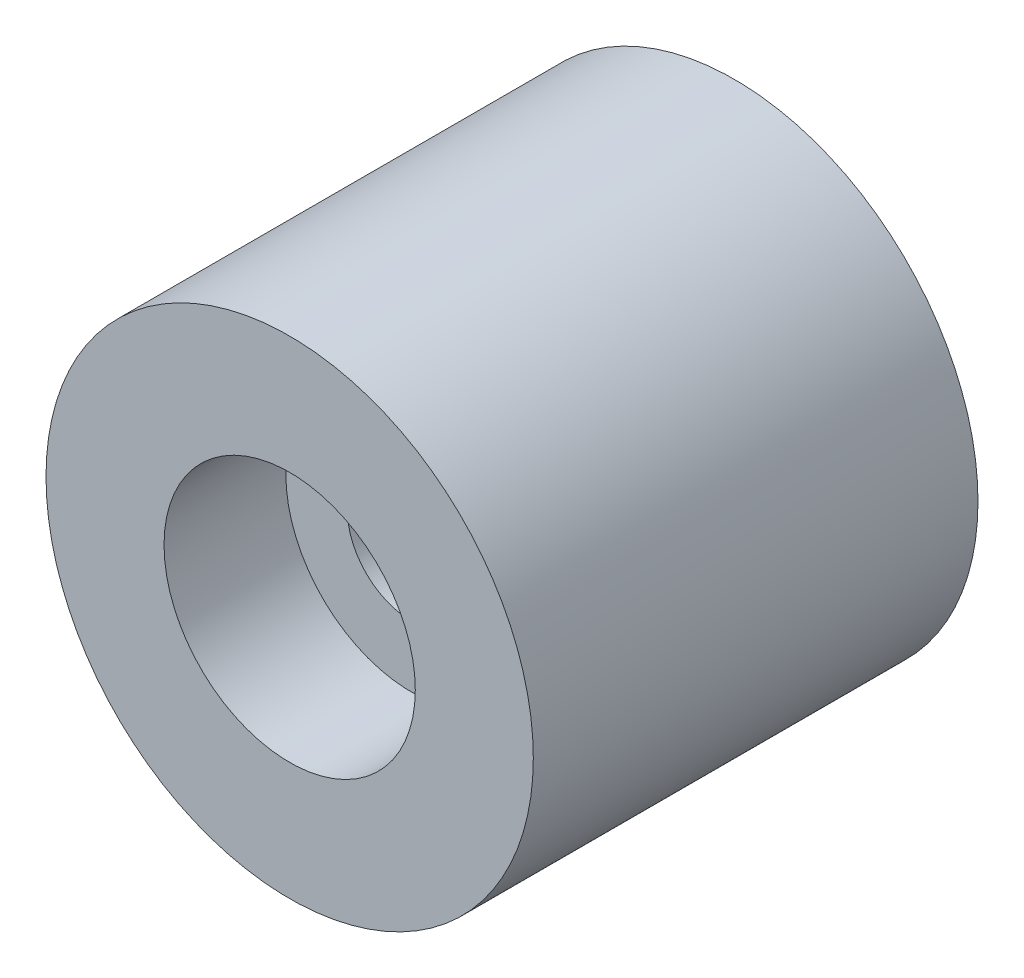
from build123d import *


with BuildPart() as part:
    # Sketch1 → Revolve1 (revolve)
    with BuildSketch(Plane(origin=(0, 0, 0), x_dir=(1, 0, 0), z_dir=(0, 1, 0))):
        Polygon((2.1082, -10.6), (4.125, -10.6), (4.125, -14.6), (8, -14.6), (8, 0), (2.1082, 0), align=None)
    revolve(axis=Axis((0, 0, 0), (0, 0, 1)))


solid = part.part
